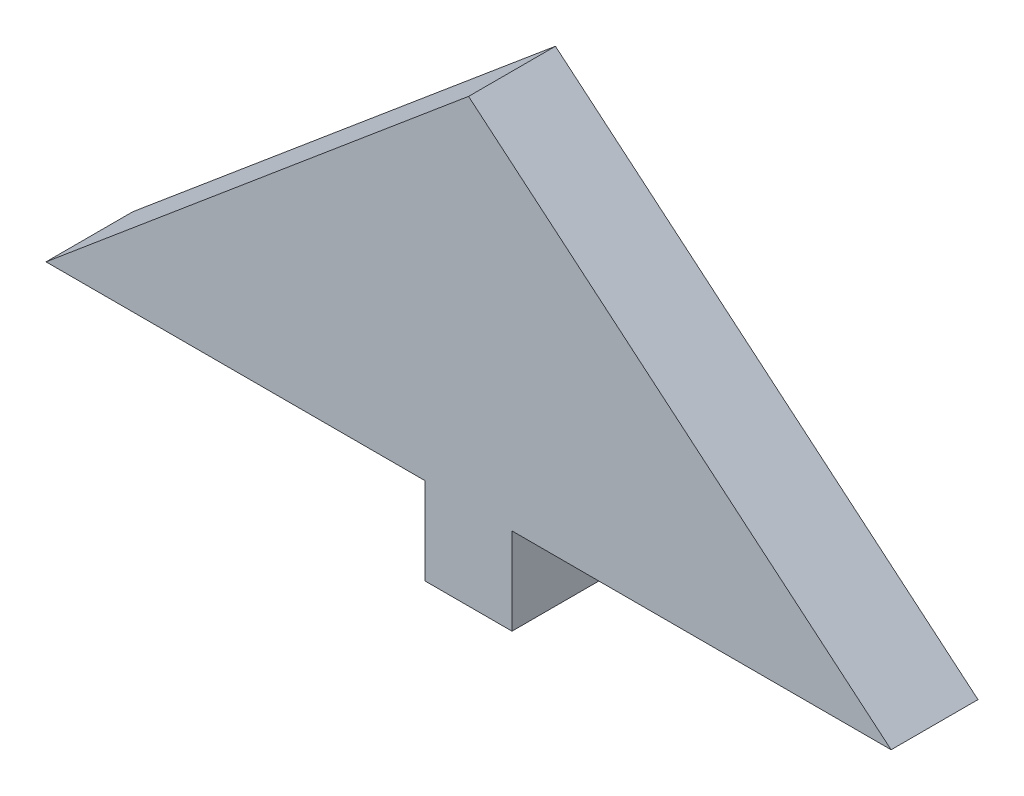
ISO-10303-21;
HEADER;
FILE_DESCRIPTION(('STEP AP214'),'2;1');
FILE_NAME('part.step','',(''),(''),'','','');
FILE_SCHEMA(('AUTOMOTIVE_DESIGN { 1 0 10303 214 1 1 1 1 }'));
ENDSEC;
DATA;
#1=APPLICATION_CONTEXT('core data for automotive mechanical design processes');
#2=APPLICATION_PROTOCOL_DEFINITION('international standard','automotive_design',2000,#1);
#3=PRODUCT_CONTEXT('',#1,'mechanical');
#4=PRODUCT('Part','Part','',(#3));
#5=PRODUCT_RELATED_PRODUCT_CATEGORY('part','',(#4));
#6=PRODUCT_DEFINITION_FORMATION('','',#4);
#7=PRODUCT_DEFINITION_CONTEXT('part definition',#1,'design');
#8=PRODUCT_DEFINITION('design','',#6,#7);
#9=PRODUCT_DEFINITION_SHAPE('','',#8);
#10=(LENGTH_UNIT() NAMED_UNIT(*) SI_UNIT(.MILLI.,.METRE.));
#11=(NAMED_UNIT(*) PLANE_ANGLE_UNIT() SI_UNIT($,.RADIAN.));
#12=(NAMED_UNIT(*) SI_UNIT($,.STERADIAN.) SOLID_ANGLE_UNIT());
#13=UNCERTAINTY_MEASURE_WITH_UNIT(LENGTH_MEASURE(1.E-05),#10,'distance_accuracy_value','');
#14=(GEOMETRIC_REPRESENTATION_CONTEXT(3) GLOBAL_UNCERTAINTY_ASSIGNED_CONTEXT((#13)) GLOBAL_UNIT_ASSIGNED_CONTEXT((#10,
#11,#12)) REPRESENTATION_CONTEXT('',''));
#15=CARTESIAN_POINT('',(0.,0.,0.));
#16=DIRECTION('',(0.,0.,1.));
#17=DIRECTION('',(1.,0.,0.));
#18=AXIS2_PLACEMENT_3D('',#15,#16,#17);
#19=CARTESIAN_POINT('',(1.5,0.,1.5));
#20=DIRECTION('',(1.,0.,0.));
#21=DIRECTION('',(0.,1.,0.));
#22=AXIS2_PLACEMENT_3D('',#19,#20,#21);
#23=PLANE('',#22);
#24=DIRECTION('',(0.,-1.,0.));
#25=VECTOR('',#24,1.);
#26=CARTESIAN_POINT('',(1.5,0.,-1.5));
#27=LINE('',#26,#25);
#28=CARTESIAN_POINT('',(1.5,3.,-1.5));
#29=VERTEX_POINT('',#28);
#30=CARTESIAN_POINT('',(1.5,0.,-1.5));
#31=VERTEX_POINT('',#30);
#32=EDGE_CURVE('E179',#29,#31,#27,.T.);
#33=ORIENTED_EDGE('',*,*,#32,.F.);
#34=DIRECTION('',(0.,0.,-1.));
#35=VECTOR('',#34,1.);
#36=CARTESIAN_POINT('',(1.5,3.,1.5));
#37=LINE('',#36,#35);
#38=CARTESIAN_POINT('',(1.5,3.,1.5));
#39=VERTEX_POINT('',#38);
#40=EDGE_CURVE('E11',#39,#29,#37,.T.);
#41=ORIENTED_EDGE('',*,*,#40,.F.);
#42=DIRECTION('',(0.,-1.,0.));
#43=VECTOR('',#42,1.);
#44=CARTESIAN_POINT('',(1.5,0.,1.5));
#45=LINE('',#44,#43);
#46=CARTESIAN_POINT('',(1.5,0.,1.5));
#47=VERTEX_POINT('',#46);
#48=EDGE_CURVE('E142',#39,#47,#45,.T.);
#49=ORIENTED_EDGE('',*,*,#48,.T.);
#50=DIRECTION('',(0.,0.,-1.));
#51=VECTOR('',#50,1.);
#52=CARTESIAN_POINT('',(1.5,0.,1.5));
#53=LINE('',#52,#51);
#54=EDGE_CURVE('E95',#47,#31,#53,.T.);
#55=ORIENTED_EDGE('',*,*,#54,.T.);
#56=EDGE_LOOP('',(#33,#41,#49,#55));
#57=FACE_BOUND('',#56,.T.);
#58=ADVANCED_FACE('F47',(#57),#23,.T.);
#59=CARTESIAN_POINT('',(0.,3.,1.5));
#60=DIRECTION('',(0.,-1.,0.));
#61=DIRECTION('',(1.,0.,0.));
#62=AXIS2_PLACEMENT_3D('',#59,#60,#61);
#63=PLANE('',#62);
#64=DIRECTION('',(-1.,0.,0.));
#65=VECTOR('',#64,1.);
#66=CARTESIAN_POINT('',(0.,3.,-1.5));
#67=LINE('',#66,#65);
#68=CARTESIAN_POINT('',(14.5931466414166,3.,-1.5));
#69=VERTEX_POINT('',#68);
#70=EDGE_CURVE('E175',#69,#29,#67,.T.);
#71=ORIENTED_EDGE('',*,*,#70,.F.);
#72=DIRECTION('',(0.,0.,-1.));
#73=VECTOR('',#72,1.);
#74=CARTESIAN_POINT('',(14.5931466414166,3.,1.5));
#75=LINE('',#74,#73);
#76=CARTESIAN_POINT('',(14.5931466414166,3.,1.5));
#77=VERTEX_POINT('',#76);
#78=EDGE_CURVE('E56',#77,#69,#75,.T.);
#79=ORIENTED_EDGE('',*,*,#78,.F.);
#80=DIRECTION('',(-1.,0.,0.));
#81=VECTOR('',#80,1.);
#82=CARTESIAN_POINT('',(0.,3.,1.5));
#83=LINE('',#82,#81);
#84=EDGE_CURVE('E134',#77,#39,#83,.T.);
#85=ORIENTED_EDGE('',*,*,#84,.T.);
#86=ORIENTED_EDGE('',*,*,#40,.T.);
#87=EDGE_LOOP('',(#71,#79,#85,#86));
#88=FACE_BOUND('',#87,.T.);
#89=ADVANCED_FACE('F176',(#88),#63,.T.);
#90=CARTESIAN_POINT('',(7.50674828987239,8.94619424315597,1.5));
#91=DIRECTION('',(0.642787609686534,0.766044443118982,0.));
#92=DIRECTION('',(-0.766044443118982,0.642787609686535,0.));
#93=AXIS2_PLACEMENT_3D('',#90,#91,#92);
#94=PLANE('',#93);
#95=DIRECTION('',(0.766044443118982,-0.642787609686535,0.));
#96=VECTOR('',#95,1.);
#97=CARTESIAN_POINT('',(7.50674828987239,8.94619424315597,-1.5));
#98=LINE('',#97,#96);
#99=CARTESIAN_POINT('',(0.,15.2451039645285,-1.5));
#100=VERTEX_POINT('',#99);
#101=EDGE_CURVE('E172',#100,#69,#98,.T.);
#102=ORIENTED_EDGE('',*,*,#101,.F.);
#103=DIRECTION('',(0.,0.,-1.));
#104=VECTOR('',#103,1.);
#105=CARTESIAN_POINT('',(0.,15.2451039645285,1.5));
#106=LINE('',#105,#104);
#107=CARTESIAN_POINT('',(0.,15.2451039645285,1.5));
#108=VERTEX_POINT('',#107);
#109=EDGE_CURVE('E164',#108,#100,#106,.T.);
#110=ORIENTED_EDGE('',*,*,#109,.F.);
#111=DIRECTION('',(0.766044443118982,-0.642787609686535,0.));
#112=VECTOR('',#111,1.);
#113=CARTESIAN_POINT('',(7.50674828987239,8.94619424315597,1.5));
#114=LINE('',#113,#112);
#115=EDGE_CURVE('E136',#108,#77,#114,.T.);
#116=ORIENTED_EDGE('',*,*,#115,.T.);
#117=ORIENTED_EDGE('',*,*,#78,.T.);
#118=EDGE_LOOP('',(#102,#110,#116,#117));
#119=FACE_BOUND('',#118,.T.);
#120=ADVANCED_FACE('F170',(#119),#94,.T.);
#121=CARTESIAN_POINT('',(-7.50674828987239,8.94619424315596,1.5));
#122=DIRECTION('',(-0.642787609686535,0.766044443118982,0.));
#123=DIRECTION('',(-0.766044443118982,-0.642787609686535,0.));
#124=AXIS2_PLACEMENT_3D('',#121,#122,#123);
#125=PLANE('',#124);
#126=DIRECTION('',(0.766044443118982,0.642787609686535,0.));
#127=VECTOR('',#126,1.);
#128=CARTESIAN_POINT('',(-7.50674828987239,8.94619424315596,-1.5));
#129=LINE('',#128,#127);
#130=CARTESIAN_POINT('',(-14.5931466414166,2.99999999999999,-1.5));
#131=VERTEX_POINT('',#130);
#132=EDGE_CURVE('E183',#131,#100,#129,.T.);
#133=ORIENTED_EDGE('',*,*,#132,.F.);
#134=DIRECTION('',(0.,0.,-1.));
#135=VECTOR('',#134,1.);
#136=CARTESIAN_POINT('',(-14.5931466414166,2.99999999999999,1.5));
#137=LINE('',#136,#135);
#138=CARTESIAN_POINT('',(-14.5931466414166,2.99999999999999,1.5));
#139=VERTEX_POINT('',#138);
#140=EDGE_CURVE('E120',#139,#131,#137,.T.);
#141=ORIENTED_EDGE('',*,*,#140,.F.);
#142=DIRECTION('',(0.766044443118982,0.642787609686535,0.));
#143=VECTOR('',#142,1.);
#144=CARTESIAN_POINT('',(-7.50674828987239,8.94619424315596,1.5));
#145=LINE('',#144,#143);
#146=EDGE_CURVE('E131',#139,#108,#145,.T.);
#147=ORIENTED_EDGE('',*,*,#146,.T.);
#148=ORIENTED_EDGE('',*,*,#109,.T.);
#149=EDGE_LOOP('',(#133,#141,#147,#148));
#150=FACE_BOUND('',#149,.T.);
#151=ADVANCED_FACE('F199',(#150),#125,.T.);
#152=CARTESIAN_POINT('',(-1.5,3.,-1.5));
#153=VERTEX_POINT('',#152);
#154=EDGE_CURVE('E118',#153,#131,#67,.T.);
#155=ORIENTED_EDGE('',*,*,#154,.F.);
#156=DIRECTION('',(0.,0.,-1.));
#157=VECTOR('',#156,1.);
#158=CARTESIAN_POINT('',(-1.5,3.,1.5));
#159=LINE('',#158,#157);
#160=CARTESIAN_POINT('',(-1.5,3.,1.5));
#161=VERTEX_POINT('',#160);
#162=EDGE_CURVE('E112',#161,#153,#159,.T.);
#163=ORIENTED_EDGE('',*,*,#162,.F.);
#164=EDGE_CURVE('E116',#161,#139,#83,.T.);
#165=ORIENTED_EDGE('',*,*,#164,.T.);
#166=ORIENTED_EDGE('',*,*,#140,.T.);
#167=EDGE_LOOP('',(#155,#163,#165,#166));
#168=FACE_BOUND('',#167,.T.);
#169=ADVANCED_FACE('F114',(#168),#63,.T.);
#170=CARTESIAN_POINT('',(-1.5,0.,1.5));
#171=DIRECTION('',(1.,0.,0.));
#172=DIRECTION('',(0.,1.,0.));
#173=AXIS2_PLACEMENT_3D('',#170,#171,#172);
#174=PLANE('',#173);
#175=DIRECTION('',(0.,-1.,0.));
#176=VECTOR('',#175,1.);
#177=CARTESIAN_POINT('',(-1.5,0.,-1.5));
#178=LINE('',#177,#176);
#179=CARTESIAN_POINT('',(-1.5,0.,-1.5));
#180=VERTEX_POINT('',#179);
#181=EDGE_CURVE('E88',#153,#180,#178,.T.);
#182=ORIENTED_EDGE('',*,*,#181,.T.);
#183=DIRECTION('',(0.,0.,-1.));
#184=VECTOR('',#183,1.);
#185=CARTESIAN_POINT('',(-1.5,0.,1.5));
#186=LINE('',#185,#184);
#187=CARTESIAN_POINT('',(-1.5,0.,1.5));
#188=VERTEX_POINT('',#187);
#189=EDGE_CURVE('E121',#188,#180,#186,.T.);
#190=ORIENTED_EDGE('',*,*,#189,.F.);
#191=DIRECTION('',(0.,-1.,0.));
#192=VECTOR('',#191,1.);
#193=CARTESIAN_POINT('',(-1.5,0.,1.5));
#194=LINE('',#193,#192);
#195=EDGE_CURVE('E123',#161,#188,#194,.T.);
#196=ORIENTED_EDGE('',*,*,#195,.F.);
#197=ORIENTED_EDGE('',*,*,#162,.T.);
#198=EDGE_LOOP('',(#182,#190,#196,#197));
#199=FACE_BOUND('',#198,.T.);
#200=ADVANCED_FACE('F124',(#199),#174,.F.);
#201=CARTESIAN_POINT('',(0.,0.,1.5));
#202=DIRECTION('',(0.,1.,0.));
#203=DIRECTION('',(-1.,0.,0.));
#204=AXIS2_PLACEMENT_3D('',#201,#202,#203);
#205=PLANE('',#204);
#206=DIRECTION('',(1.,0.,0.));
#207=VECTOR('',#206,1.);
#208=CARTESIAN_POINT('',(0.,0.,-1.5));
#209=LINE('',#208,#207);
#210=EDGE_CURVE('E148',#180,#31,#209,.T.);
#211=ORIENTED_EDGE('',*,*,#210,.T.);
#212=ORIENTED_EDGE('',*,*,#54,.F.);
#213=DIRECTION('',(1.,0.,0.));
#214=VECTOR('',#213,1.);
#215=CARTESIAN_POINT('',(0.,0.,1.5));
#216=LINE('',#215,#214);
#217=EDGE_CURVE('E64',#188,#47,#216,.T.);
#218=ORIENTED_EDGE('',*,*,#217,.F.);
#219=ORIENTED_EDGE('',*,*,#189,.T.);
#220=EDGE_LOOP('',(#211,#212,#218,#219));
#221=FACE_BOUND('',#220,.T.);
#222=ADVANCED_FACE('F207',(#221),#205,.F.);
#223=CARTESIAN_POINT('',(0.,0.,1.5));
#224=DIRECTION('',(0.,0.,1.));
#225=DIRECTION('',(1.,0.,0.));
#226=AXIS2_PLACEMENT_3D('',#223,#224,#225);
#227=PLANE('',#226);
#228=ORIENTED_EDGE('',*,*,#48,.F.);
#229=ORIENTED_EDGE('',*,*,#84,.F.);
#230=ORIENTED_EDGE('',*,*,#115,.F.);
#231=ORIENTED_EDGE('',*,*,#146,.F.);
#232=ORIENTED_EDGE('',*,*,#164,.F.);
#233=ORIENTED_EDGE('',*,*,#195,.T.);
#234=ORIENTED_EDGE('',*,*,#217,.T.);
#235=EDGE_LOOP('',(#228,#229,#230,#231,#232,#233,#234));
#236=FACE_BOUND('',#235,.T.);
#237=ADVANCED_FACE('F128',(#236),#227,.T.);
#238=CARTESIAN_POINT('',(0.,0.,-1.5));
#239=DIRECTION('',(0.,0.,1.));
#240=DIRECTION('',(1.,0.,0.));
#241=AXIS2_PLACEMENT_3D('',#238,#239,#240);
#242=PLANE('',#241);
#243=ORIENTED_EDGE('',*,*,#32,.T.);
#244=ORIENTED_EDGE('',*,*,#210,.F.);
#245=ORIENTED_EDGE('',*,*,#181,.F.);
#246=ORIENTED_EDGE('',*,*,#154,.T.);
#247=ORIENTED_EDGE('',*,*,#132,.T.);
#248=ORIENTED_EDGE('',*,*,#101,.T.);
#249=ORIENTED_EDGE('',*,*,#70,.T.);
#250=EDGE_LOOP('',(#243,#244,#245,#246,#247,#248,#249));
#251=FACE_BOUND('',#250,.T.);
#252=ADVANCED_FACE('F181',(#251),#242,.F.);
#253=CLOSED_SHELL('',(#58,#89,#120,#151,#169,#200,#222,#237,#252));
#254=MANIFOLD_SOLID_BREP('B2',#253);
#255=ADVANCED_BREP_SHAPE_REPRESENTATION('',(#18,#254),#14);
#256=SHAPE_DEFINITION_REPRESENTATION(#9,#255);
ENDSEC;
END-ISO-10303-21;
